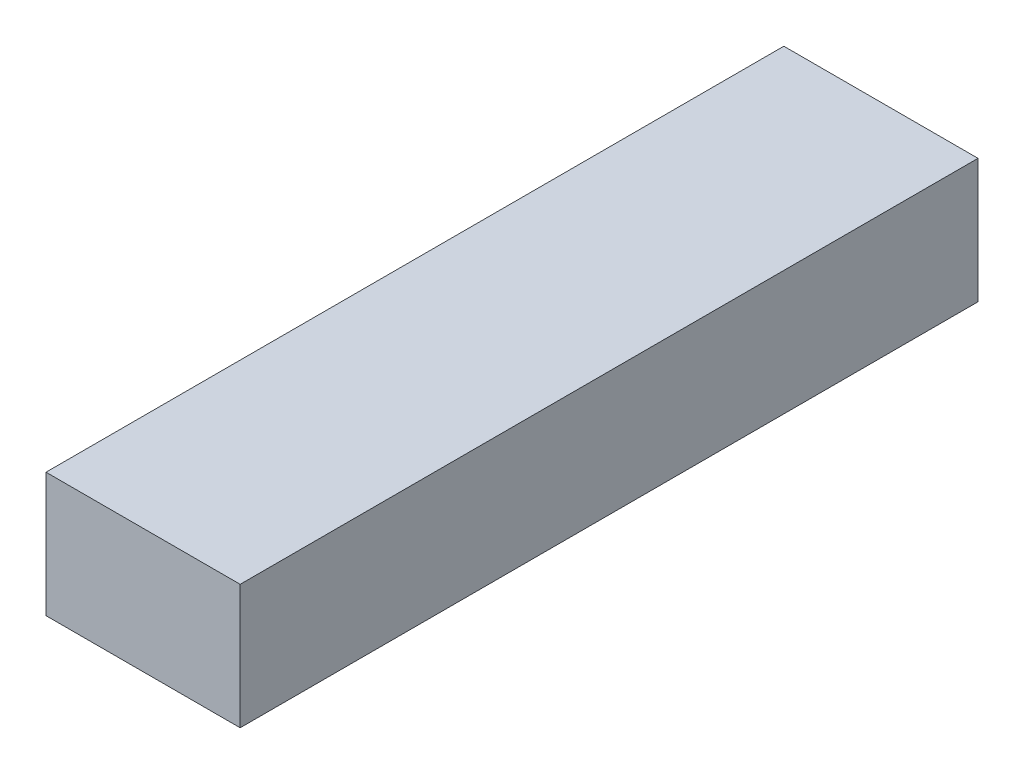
ISO-10303-21;
HEADER;
FILE_DESCRIPTION(('STEP AP214'),'2;1');
FILE_NAME('part.step','',(''),(''),'','','');
FILE_SCHEMA(('AUTOMOTIVE_DESIGN { 1 0 10303 214 1 1 1 1 }'));
ENDSEC;
DATA;
#1=APPLICATION_CONTEXT('core data for automotive mechanical design processes');
#2=APPLICATION_PROTOCOL_DEFINITION('international standard','automotive_design',2000,#1);
#3=PRODUCT_CONTEXT('',#1,'mechanical');
#4=PRODUCT('Part','Part','',(#3));
#5=PRODUCT_RELATED_PRODUCT_CATEGORY('part','',(#4));
#6=PRODUCT_DEFINITION_FORMATION('','',#4);
#7=PRODUCT_DEFINITION_CONTEXT('part definition',#1,'design');
#8=PRODUCT_DEFINITION('design','',#6,#7);
#9=PRODUCT_DEFINITION_SHAPE('','',#8);
#10=(LENGTH_UNIT() NAMED_UNIT(*) SI_UNIT(.MILLI.,.METRE.));
#11=(NAMED_UNIT(*) PLANE_ANGLE_UNIT() SI_UNIT($,.RADIAN.));
#12=(NAMED_UNIT(*) SI_UNIT($,.STERADIAN.) SOLID_ANGLE_UNIT());
#13=UNCERTAINTY_MEASURE_WITH_UNIT(LENGTH_MEASURE(1.E-05),#10,'distance_accuracy_value','');
#14=(GEOMETRIC_REPRESENTATION_CONTEXT(3) GLOBAL_UNCERTAINTY_ASSIGNED_CONTEXT((#13)) GLOBAL_UNIT_ASSIGNED_CONTEXT((#10,
#11,#12)) REPRESENTATION_CONTEXT('',''));
#15=CARTESIAN_POINT('',(0.,0.,0.));
#16=DIRECTION('',(0.,0.,1.));
#17=DIRECTION('',(1.,0.,0.));
#18=AXIS2_PLACEMENT_3D('',#15,#16,#17);
#19=CARTESIAN_POINT('',(-27.5,-17.5,-95.));
#20=DIRECTION('',(0.,0.,1.));
#21=DIRECTION('',(1.,0.,0.));
#22=AXIS2_PLACEMENT_3D('',#19,#20,#21);
#23=PLANE('',#22);
#24=DIRECTION('',(-1.,0.,0.));
#25=VECTOR('',#24,1.);
#26=CARTESIAN_POINT('',(25.,16.,-95.));
#27=LINE('',#26,#25);
#28=CARTESIAN_POINT('',(25.,16.,-95.));
#29=VERTEX_POINT('',#28);
#30=CARTESIAN_POINT('',(-25.,16.,-95.));
#31=VERTEX_POINT('',#30);
#32=EDGE_CURVE('E59',#29,#31,#27,.T.);
#33=ORIENTED_EDGE('',*,*,#32,.F.);
#34=DIRECTION('',(0.,1.,0.));
#35=VECTOR('',#34,1.);
#36=CARTESIAN_POINT('',(25.,-16.,-95.));
#37=LINE('',#36,#35);
#38=CARTESIAN_POINT('',(25.,-16.,-95.));
#39=VERTEX_POINT('',#38);
#40=EDGE_CURVE('E83',#39,#29,#37,.T.);
#41=ORIENTED_EDGE('',*,*,#40,.F.);
#42=DIRECTION('',(1.,0.,0.));
#43=VECTOR('',#42,1.);
#44=CARTESIAN_POINT('',(-25.,-16.,-95.));
#45=LINE('',#44,#43);
#46=CARTESIAN_POINT('',(-25.,-16.,-95.));
#47=VERTEX_POINT('',#46);
#48=EDGE_CURVE('E99',#47,#39,#45,.T.);
#49=ORIENTED_EDGE('',*,*,#48,.F.);
#50=DIRECTION('',(0.,-1.,0.));
#51=VECTOR('',#50,1.);
#52=CARTESIAN_POINT('',(-25.,16.,-95.));
#53=LINE('',#52,#51);
#54=EDGE_CURVE('E97',#31,#47,#53,.T.);
#55=ORIENTED_EDGE('',*,*,#54,.F.);
#56=EDGE_LOOP('',(#33,#41,#49,#55));
#57=FACE_BOUND('',#56,.T.);
#58=ADVANCED_FACE('F35',(#57),#23,.F.);
#59=CARTESIAN_POINT('',(25.,16.,-95.));
#60=DIRECTION('',(0.,1.,0.));
#61=DIRECTION('',(-1.,0.,0.));
#62=AXIS2_PLACEMENT_3D('',#59,#60,#61);
#63=PLANE('',#62);
#64=DIRECTION('',(0.,0.,1.));
#65=VECTOR('',#64,1.);
#66=CARTESIAN_POINT('',(25.,16.,-95.));
#67=LINE('',#66,#65);
#68=CARTESIAN_POINT('',(25.,16.,95.));
#69=VERTEX_POINT('',#68);
#70=EDGE_CURVE('E11',#29,#69,#67,.T.);
#71=ORIENTED_EDGE('',*,*,#70,.F.);
#72=ORIENTED_EDGE('',*,*,#32,.T.);
#73=DIRECTION('',(0.,0.,1.));
#74=VECTOR('',#73,1.);
#75=CARTESIAN_POINT('',(-25.,16.,-95.));
#76=LINE('',#75,#74);
#77=CARTESIAN_POINT('',(-25.,16.,95.));
#78=VERTEX_POINT('',#77);
#79=EDGE_CURVE('E38',#31,#78,#76,.T.);
#80=ORIENTED_EDGE('',*,*,#79,.T.);
#81=DIRECTION('',(-1.,0.,0.));
#82=VECTOR('',#81,1.);
#83=CARTESIAN_POINT('',(25.,16.,95.));
#84=LINE('',#83,#82);
#85=EDGE_CURVE('E77',#69,#78,#84,.T.);
#86=ORIENTED_EDGE('',*,*,#85,.F.);
#87=EDGE_LOOP('',(#71,#72,#80,#86));
#88=FACE_BOUND('',#87,.T.);
#89=ADVANCED_FACE('F75',(#88),#63,.T.);
#90=CARTESIAN_POINT('',(25.,-16.,-95.));
#91=DIRECTION('',(1.,0.,0.));
#92=DIRECTION('',(0.,1.,0.));
#93=AXIS2_PLACEMENT_3D('',#90,#91,#92);
#94=PLANE('',#93);
#95=DIRECTION('',(0.,0.,1.));
#96=VECTOR('',#95,1.);
#97=CARTESIAN_POINT('',(25.,-16.,-95.));
#98=LINE('',#97,#96);
#99=CARTESIAN_POINT('',(25.,-16.,95.));
#100=VERTEX_POINT('',#99);
#101=EDGE_CURVE('E43',#39,#100,#98,.T.);
#102=ORIENTED_EDGE('',*,*,#101,.F.);
#103=ORIENTED_EDGE('',*,*,#40,.T.);
#104=ORIENTED_EDGE('',*,*,#70,.T.);
#105=DIRECTION('',(0.,1.,0.));
#106=VECTOR('',#105,1.);
#107=CARTESIAN_POINT('',(25.,-16.,95.));
#108=LINE('',#107,#106);
#109=EDGE_CURVE('E91',#100,#69,#108,.T.);
#110=ORIENTED_EDGE('',*,*,#109,.F.);
#111=EDGE_LOOP('',(#102,#103,#104,#110));
#112=FACE_BOUND('',#111,.T.);
#113=ADVANCED_FACE('F108',(#112),#94,.T.);
#114=CARTESIAN_POINT('',(-25.,-16.,-95.));
#115=DIRECTION('',(0.,-1.,0.));
#116=DIRECTION('',(0.,0.,-1.));
#117=AXIS2_PLACEMENT_3D('',#114,#115,#116);
#118=PLANE('',#117);
#119=DIRECTION('',(0.,0.,1.));
#120=VECTOR('',#119,1.);
#121=CARTESIAN_POINT('',(-25.,-16.,-95.));
#122=LINE('',#121,#120);
#123=CARTESIAN_POINT('',(-25.,-16.,95.));
#124=VERTEX_POINT('',#123);
#125=EDGE_CURVE('E82',#47,#124,#122,.T.);
#126=ORIENTED_EDGE('',*,*,#125,.F.);
#127=ORIENTED_EDGE('',*,*,#48,.T.);
#128=ORIENTED_EDGE('',*,*,#101,.T.);
#129=DIRECTION('',(1.,0.,0.));
#130=VECTOR('',#129,1.);
#131=CARTESIAN_POINT('',(-25.,-16.,95.));
#132=LINE('',#131,#130);
#133=EDGE_CURVE('E51',#124,#100,#132,.T.);
#134=ORIENTED_EDGE('',*,*,#133,.F.);
#135=EDGE_LOOP('',(#126,#127,#128,#134));
#136=FACE_BOUND('',#135,.T.);
#137=ADVANCED_FACE('F104',(#136),#118,.T.);
#138=CARTESIAN_POINT('',(-25.,16.,-95.));
#139=DIRECTION('',(-1.,0.,0.));
#140=DIRECTION('',(0.,-1.,0.));
#141=AXIS2_PLACEMENT_3D('',#138,#139,#140);
#142=PLANE('',#141);
#143=ORIENTED_EDGE('',*,*,#79,.F.);
#144=ORIENTED_EDGE('',*,*,#54,.T.);
#145=ORIENTED_EDGE('',*,*,#125,.T.);
#146=DIRECTION('',(0.,-1.,0.));
#147=VECTOR('',#146,1.);
#148=CARTESIAN_POINT('',(-25.,16.,95.));
#149=LINE('',#148,#147);
#150=EDGE_CURVE('E85',#78,#124,#149,.T.);
#151=ORIENTED_EDGE('',*,*,#150,.F.);
#152=EDGE_LOOP('',(#143,#144,#145,#151));
#153=FACE_BOUND('',#152,.T.);
#154=ADVANCED_FACE('F86',(#153),#142,.T.);
#155=CARTESIAN_POINT('',(-27.5,-17.5,95.));
#156=DIRECTION('',(0.,0.,1.));
#157=DIRECTION('',(1.,0.,0.));
#158=AXIS2_PLACEMENT_3D('',#155,#156,#157);
#159=PLANE('',#158);
#160=ORIENTED_EDGE('',*,*,#109,.T.);
#161=ORIENTED_EDGE('',*,*,#85,.T.);
#162=ORIENTED_EDGE('',*,*,#150,.T.);
#163=ORIENTED_EDGE('',*,*,#133,.T.);
#164=EDGE_LOOP('',(#160,#161,#162,#163));
#165=FACE_BOUND('',#164,.T.);
#166=ADVANCED_FACE('F89',(#165),#159,.T.);
#167=CLOSED_SHELL('',(#58,#89,#113,#137,#154,#166));
#168=MANIFOLD_SOLID_BREP('B2',#167);
#169=ADVANCED_BREP_SHAPE_REPRESENTATION('',(#18,#168),#14);
#170=SHAPE_DEFINITION_REPRESENTATION(#9,#169);
ENDSEC;
END-ISO-10303-21;
